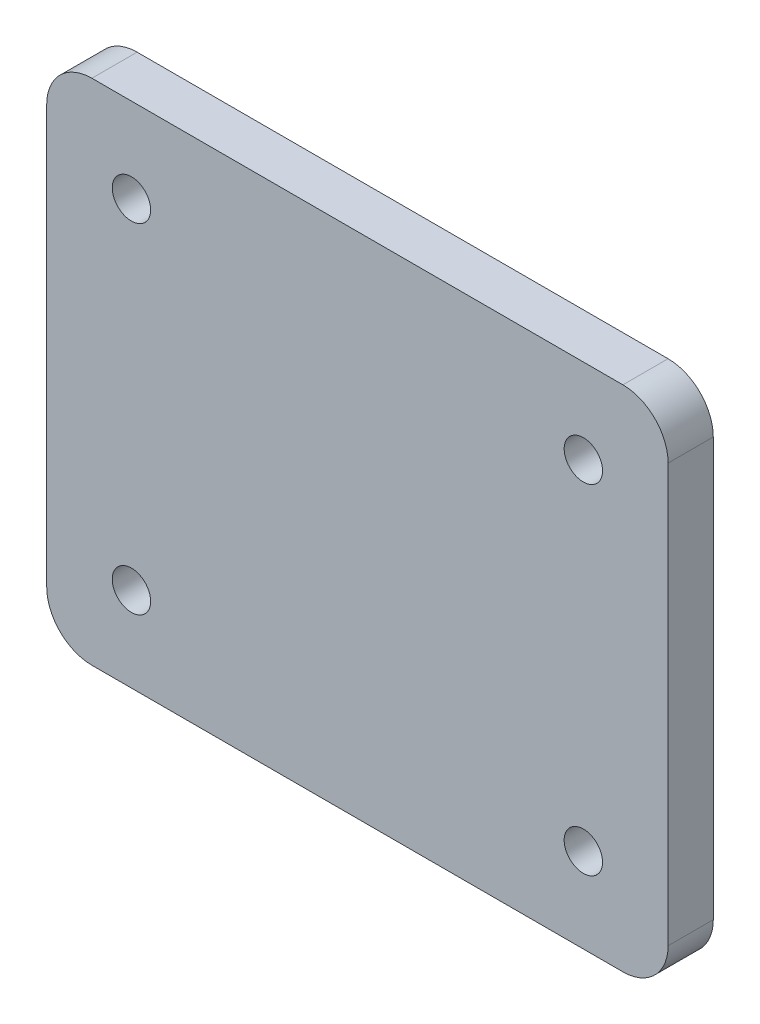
ISO-10303-21;
HEADER;
FILE_DESCRIPTION(('STEP AP214'),'2;1');
FILE_NAME('part.step','',(''),(''),'','','');
FILE_SCHEMA(('AUTOMOTIVE_DESIGN { 1 0 10303 214 1 1 1 1 }'));
ENDSEC;
DATA;
#1=APPLICATION_CONTEXT('core data for automotive mechanical design processes');
#2=APPLICATION_PROTOCOL_DEFINITION('international standard','automotive_design',2000,#1);
#3=PRODUCT_CONTEXT('',#1,'mechanical');
#4=PRODUCT('Part','Part','',(#3));
#5=PRODUCT_RELATED_PRODUCT_CATEGORY('part','',(#4));
#6=PRODUCT_DEFINITION_FORMATION('','',#4);
#7=PRODUCT_DEFINITION_CONTEXT('part definition',#1,'design');
#8=PRODUCT_DEFINITION('design','',#6,#7);
#9=PRODUCT_DEFINITION_SHAPE('','',#8);
#10=(LENGTH_UNIT() NAMED_UNIT(*) SI_UNIT(.MILLI.,.METRE.));
#11=(NAMED_UNIT(*) PLANE_ANGLE_UNIT() SI_UNIT($,.RADIAN.));
#12=(NAMED_UNIT(*) SI_UNIT($,.STERADIAN.) SOLID_ANGLE_UNIT());
#13=UNCERTAINTY_MEASURE_WITH_UNIT(LENGTH_MEASURE(1.E-05),#10,'distance_accuracy_value','');
#14=(GEOMETRIC_REPRESENTATION_CONTEXT(3) GLOBAL_UNCERTAINTY_ASSIGNED_CONTEXT((#13)) GLOBAL_UNIT_ASSIGNED_CONTEXT((#10,
#11,#12)) REPRESENTATION_CONTEXT('',''));
#15=CARTESIAN_POINT('',(0.,0.,0.));
#16=DIRECTION('',(0.,0.,1.));
#17=DIRECTION('',(1.,0.,0.));
#18=AXIS2_PLACEMENT_3D('',#15,#16,#17);
#19=CARTESIAN_POINT('',(102.,8.00000000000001,-8.));
#20=DIRECTION('',(0.,0.,1.));
#21=DIRECTION('',(1.,0.,0.));
#22=AXIS2_PLACEMENT_3D('',#19,#20,#21);
#23=CYLINDRICAL_SURFACE('',#22,8.00000000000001);
#24=CARTESIAN_POINT('',(102.,8.00000000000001,0.));
#25=DIRECTION('',(0.,0.,1.));
#26=DIRECTION('',(1.,0.,0.));
#27=AXIS2_PLACEMENT_3D('',#24,#25,#26);
#28=CIRCLE('',#27,8.00000000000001);
#29=CARTESIAN_POINT('',(102.,0.,0.));
#30=VERTEX_POINT('',#29);
#31=CARTESIAN_POINT('',(110.,8.00000000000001,0.));
#32=VERTEX_POINT('',#31);
#33=EDGE_CURVE('E129',#30,#32,#28,.T.);
#34=ORIENTED_EDGE('',*,*,#33,.F.);
#35=DIRECTION('',(0.,0.,1.));
#36=VECTOR('',#35,1.);
#37=CARTESIAN_POINT('',(102.,0.,-8.));
#38=LINE('',#37,#36);
#39=CARTESIAN_POINT('',(102.,0.,-8.));
#40=VERTEX_POINT('',#39);
#41=EDGE_CURVE('E11',#40,#30,#38,.T.);
#42=ORIENTED_EDGE('',*,*,#41,.F.);
#43=CARTESIAN_POINT('',(102.,8.00000000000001,-8.));
#44=DIRECTION('',(0.,0.,1.));
#45=DIRECTION('',(1.,0.,0.));
#46=AXIS2_PLACEMENT_3D('',#43,#44,#45);
#47=CIRCLE('',#46,8.00000000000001);
#48=CARTESIAN_POINT('',(110.,8.00000000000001,-8.));
#49=VERTEX_POINT('',#48);
#50=EDGE_CURVE('E150',#40,#49,#47,.T.);
#51=ORIENTED_EDGE('',*,*,#50,.T.);
#52=DIRECTION('',(0.,0.,1.));
#53=VECTOR('',#52,1.);
#54=CARTESIAN_POINT('',(110.,8.00000000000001,-8.));
#55=LINE('',#54,#53);
#56=EDGE_CURVE('E35',#49,#32,#55,.T.);
#57=ORIENTED_EDGE('',*,*,#56,.T.);
#58=EDGE_LOOP('',(#34,#42,#51,#57));
#59=FACE_BOUND('',#58,.T.);
#60=ADVANCED_FACE('F32',(#59),#23,.T.);
#61=CARTESIAN_POINT('',(102.,0.,-8.));
#62=DIRECTION('',(0.,-1.,0.));
#63=DIRECTION('',(0.,0.,-1.));
#64=AXIS2_PLACEMENT_3D('',#61,#62,#63);
#65=PLANE('',#64);
#66=DIRECTION('',(1.,0.,0.));
#67=VECTOR('',#66,1.);
#68=CARTESIAN_POINT('',(102.,0.,0.));
#69=LINE('',#68,#67);
#70=CARTESIAN_POINT('',(8.,0.,0.));
#71=VERTEX_POINT('',#70);
#72=EDGE_CURVE('E148',#71,#30,#69,.T.);
#73=ORIENTED_EDGE('',*,*,#72,.F.);
#74=DIRECTION('',(0.,0.,1.));
#75=VECTOR('',#74,1.);
#76=CARTESIAN_POINT('',(8.,0.,-8.));
#77=LINE('',#76,#75);
#78=CARTESIAN_POINT('',(8.,0.,-8.));
#79=VERTEX_POINT('',#78);
#80=EDGE_CURVE('E41',#79,#71,#77,.T.);
#81=ORIENTED_EDGE('',*,*,#80,.F.);
#82=DIRECTION('',(1.,0.,0.));
#83=VECTOR('',#82,1.);
#84=CARTESIAN_POINT('',(102.,0.,-8.));
#85=LINE('',#84,#83);
#86=EDGE_CURVE('E119',#79,#40,#85,.T.);
#87=ORIENTED_EDGE('',*,*,#86,.T.);
#88=ORIENTED_EDGE('',*,*,#41,.T.);
#89=EDGE_LOOP('',(#73,#81,#87,#88));
#90=FACE_BOUND('',#89,.T.);
#91=ADVANCED_FACE('F162',(#90),#65,.T.);
#92=CARTESIAN_POINT('',(8.,8.00000000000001,-8.));
#93=DIRECTION('',(0.,0.,1.));
#94=DIRECTION('',(1.,0.,0.));
#95=AXIS2_PLACEMENT_3D('',#92,#93,#94);
#96=CYLINDRICAL_SURFACE('',#95,8.);
#97=CARTESIAN_POINT('',(8.,8.00000000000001,0.));
#98=DIRECTION('',(0.,0.,1.));
#99=DIRECTION('',(1.,0.,0.));
#100=AXIS2_PLACEMENT_3D('',#97,#98,#99);
#101=CIRCLE('',#100,8.);
#102=CARTESIAN_POINT('',(0.,8.00000000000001,0.));
#103=VERTEX_POINT('',#102);
#104=EDGE_CURVE('E106',#103,#71,#101,.T.);
#105=ORIENTED_EDGE('',*,*,#104,.F.);
#106=DIRECTION('',(0.,0.,1.));
#107=VECTOR('',#106,1.);
#108=CARTESIAN_POINT('',(0.,8.00000000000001,-8.));
#109=LINE('',#108,#107);
#110=CARTESIAN_POINT('',(0.,8.00000000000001,-8.));
#111=VERTEX_POINT('',#110);
#112=EDGE_CURVE('E101',#111,#103,#109,.T.);
#113=ORIENTED_EDGE('',*,*,#112,.F.);
#114=CARTESIAN_POINT('',(8.,8.00000000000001,-8.));
#115=DIRECTION('',(0.,0.,1.));
#116=DIRECTION('',(1.,0.,0.));
#117=AXIS2_PLACEMENT_3D('',#114,#115,#116);
#118=CIRCLE('',#117,8.);
#119=EDGE_CURVE('E104',#111,#79,#118,.T.);
#120=ORIENTED_EDGE('',*,*,#119,.T.);
#121=ORIENTED_EDGE('',*,*,#80,.T.);
#122=EDGE_LOOP('',(#105,#113,#120,#121));
#123=FACE_BOUND('',#122,.T.);
#124=ADVANCED_FACE('F103',(#123),#96,.T.);
#125=CARTESIAN_POINT('',(0.,8.00000000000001,-8.));
#126=DIRECTION('',(-1.,0.,0.));
#127=DIRECTION('',(0.,0.,1.));
#128=AXIS2_PLACEMENT_3D('',#125,#126,#127);
#129=PLANE('',#128);
#130=DIRECTION('',(0.,-1.,0.));
#131=VECTOR('',#130,1.);
#132=CARTESIAN_POINT('',(0.,8.00000000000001,0.));
#133=LINE('',#132,#131);
#134=CARTESIAN_POINT('',(0.,82.,0.));
#135=VERTEX_POINT('',#134);
#136=EDGE_CURVE('E145',#135,#103,#133,.T.);
#137=ORIENTED_EDGE('',*,*,#136,.F.);
#138=DIRECTION('',(0.,0.,1.));
#139=VECTOR('',#138,1.);
#140=CARTESIAN_POINT('',(0.,82.,-8.));
#141=LINE('',#140,#139);
#142=CARTESIAN_POINT('',(0.,82.,-8.));
#143=VERTEX_POINT('',#142);
#144=EDGE_CURVE('E111',#143,#135,#141,.T.);
#145=ORIENTED_EDGE('',*,*,#144,.F.);
#146=DIRECTION('',(0.,-1.,0.));
#147=VECTOR('',#146,1.);
#148=CARTESIAN_POINT('',(0.,8.00000000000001,-8.));
#149=LINE('',#148,#147);
#150=EDGE_CURVE('E117',#143,#111,#149,.T.);
#151=ORIENTED_EDGE('',*,*,#150,.T.);
#152=ORIENTED_EDGE('',*,*,#112,.T.);
#153=EDGE_LOOP('',(#137,#145,#151,#152));
#154=FACE_BOUND('',#153,.T.);
#155=ADVANCED_FACE('F121',(#154),#129,.T.);
#156=CARTESIAN_POINT('',(8.,82.,-8.));
#157=DIRECTION('',(0.,0.,1.));
#158=DIRECTION('',(1.,0.,0.));
#159=AXIS2_PLACEMENT_3D('',#156,#157,#158);
#160=CYLINDRICAL_SURFACE('',#159,8.);
#161=CARTESIAN_POINT('',(8.,82.,0.));
#162=DIRECTION('',(0.,0.,1.));
#163=DIRECTION('',(1.,0.,0.));
#164=AXIS2_PLACEMENT_3D('',#161,#162,#163);
#165=CIRCLE('',#164,8.);
#166=CARTESIAN_POINT('',(8.,90.,0.));
#167=VERTEX_POINT('',#166);
#168=EDGE_CURVE('E142',#167,#135,#165,.T.);
#169=ORIENTED_EDGE('',*,*,#168,.F.);
#170=DIRECTION('',(0.,0.,1.));
#171=VECTOR('',#170,1.);
#172=CARTESIAN_POINT('',(8.,90.,-8.));
#173=LINE('',#172,#171);
#174=CARTESIAN_POINT('',(8.,90.,-8.));
#175=VERTEX_POINT('',#174);
#176=EDGE_CURVE('E154',#175,#167,#173,.T.);
#177=ORIENTED_EDGE('',*,*,#176,.F.);
#178=CARTESIAN_POINT('',(8.,82.,-8.));
#179=DIRECTION('',(0.,0.,1.));
#180=DIRECTION('',(1.,0.,0.));
#181=AXIS2_PLACEMENT_3D('',#178,#179,#180);
#182=CIRCLE('',#181,8.);
#183=EDGE_CURVE('E122',#175,#143,#182,.T.);
#184=ORIENTED_EDGE('',*,*,#183,.T.);
#185=ORIENTED_EDGE('',*,*,#144,.T.);
#186=EDGE_LOOP('',(#169,#177,#184,#185));
#187=FACE_BOUND('',#186,.T.);
#188=ADVANCED_FACE('F175',(#187),#160,.T.);
#189=CARTESIAN_POINT('',(102.,90.,-8.));
#190=DIRECTION('',(0.,1.,0.));
#191=DIRECTION('',(0.,0.,1.));
#192=AXIS2_PLACEMENT_3D('',#189,#190,#191);
#193=PLANE('',#192);
#194=DIRECTION('',(-1.,0.,0.));
#195=VECTOR('',#194,1.);
#196=CARTESIAN_POINT('',(102.,90.,0.));
#197=LINE('',#196,#195);
#198=CARTESIAN_POINT('',(102.,90.,0.));
#199=VERTEX_POINT('',#198);
#200=EDGE_CURVE('E139',#199,#167,#197,.T.);
#201=ORIENTED_EDGE('',*,*,#200,.F.);
#202=DIRECTION('',(0.,0.,1.));
#203=VECTOR('',#202,1.);
#204=CARTESIAN_POINT('',(102.,90.,-8.));
#205=LINE('',#204,#203);
#206=CARTESIAN_POINT('',(102.,90.,-8.));
#207=VERTEX_POINT('',#206);
#208=EDGE_CURVE('E156',#207,#199,#205,.T.);
#209=ORIENTED_EDGE('',*,*,#208,.F.);
#210=DIRECTION('',(-1.,0.,0.));
#211=VECTOR('',#210,1.);
#212=CARTESIAN_POINT('',(102.,90.,-8.));
#213=LINE('',#212,#211);
#214=EDGE_CURVE('E124',#207,#175,#213,.T.);
#215=ORIENTED_EDGE('',*,*,#214,.T.);
#216=ORIENTED_EDGE('',*,*,#176,.T.);
#217=EDGE_LOOP('',(#201,#209,#215,#216));
#218=FACE_BOUND('',#217,.T.);
#219=ADVANCED_FACE('F178',(#218),#193,.T.);
#220=CARTESIAN_POINT('',(102.,82.,-8.));
#221=DIRECTION('',(0.,0.,1.));
#222=DIRECTION('',(1.,0.,0.));
#223=AXIS2_PLACEMENT_3D('',#220,#221,#222);
#224=CYLINDRICAL_SURFACE('',#223,8.00000000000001);
#225=CARTESIAN_POINT('',(102.,82.,0.));
#226=DIRECTION('',(0.,0.,1.));
#227=DIRECTION('',(1.,0.,0.));
#228=AXIS2_PLACEMENT_3D('',#225,#226,#227);
#229=CIRCLE('',#228,8.00000000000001);
#230=CARTESIAN_POINT('',(110.,82.,0.));
#231=VERTEX_POINT('',#230);
#232=EDGE_CURVE('E136',#231,#199,#229,.T.);
#233=ORIENTED_EDGE('',*,*,#232,.F.);
#234=DIRECTION('',(0.,0.,1.));
#235=VECTOR('',#234,1.);
#236=CARTESIAN_POINT('',(110.,82.,-8.));
#237=LINE('',#236,#235);
#238=CARTESIAN_POINT('',(110.,82.,-8.));
#239=VERTEX_POINT('',#238);
#240=EDGE_CURVE('E157',#239,#231,#237,.T.);
#241=ORIENTED_EDGE('',*,*,#240,.F.);
#242=CARTESIAN_POINT('',(102.,82.,-8.));
#243=DIRECTION('',(0.,0.,1.));
#244=DIRECTION('',(1.,0.,0.));
#245=AXIS2_PLACEMENT_3D('',#242,#243,#244);
#246=CIRCLE('',#245,8.00000000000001);
#247=EDGE_CURVE('E244',#239,#207,#246,.T.);
#248=ORIENTED_EDGE('',*,*,#247,.T.);
#249=ORIENTED_EDGE('',*,*,#208,.T.);
#250=EDGE_LOOP('',(#233,#241,#248,#249));
#251=FACE_BOUND('',#250,.T.);
#252=ADVANCED_FACE('F182',(#251),#224,.T.);
#253=CARTESIAN_POINT('',(110.,8.00000000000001,-8.));
#254=DIRECTION('',(1.,0.,0.));
#255=DIRECTION('',(0.,0.,-1.));
#256=AXIS2_PLACEMENT_3D('',#253,#254,#255);
#257=PLANE('',#256);
#258=DIRECTION('',(0.,1.,0.));
#259=VECTOR('',#258,1.);
#260=CARTESIAN_POINT('',(110.,8.00000000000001,0.));
#261=LINE('',#260,#259);
#262=EDGE_CURVE('E132',#32,#231,#261,.T.);
#263=ORIENTED_EDGE('',*,*,#262,.F.);
#264=ORIENTED_EDGE('',*,*,#56,.F.);
#265=DIRECTION('',(0.,1.,0.));
#266=VECTOR('',#265,1.);
#267=CARTESIAN_POINT('',(110.,8.00000000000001,-8.));
#268=LINE('',#267,#266);
#269=EDGE_CURVE('E242',#49,#239,#268,.T.);
#270=ORIENTED_EDGE('',*,*,#269,.T.);
#271=ORIENTED_EDGE('',*,*,#240,.T.);
#272=EDGE_LOOP('',(#263,#264,#270,#271));
#273=FACE_BOUND('',#272,.T.);
#274=ADVANCED_FACE('F159',(#273),#257,.T.);
#275=CARTESIAN_POINT('',(102.,8.00000000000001,-8.));
#276=DIRECTION('',(0.,0.,1.));
#277=DIRECTION('',(1.,0.,0.));
#278=AXIS2_PLACEMENT_3D('',#275,#276,#277);
#279=PLANE('',#278);
#280=CARTESIAN_POINT('',(15.,75.,-8.));
#281=DIRECTION('',(0.,0.,1.));
#282=DIRECTION('',(1.,0.,0.));
#283=AXIS2_PLACEMENT_3D('',#280,#281,#282);
#284=CIRCLE('',#283,3.4);
#285=CARTESIAN_POINT('',(18.4,75.,-8.));
#286=VERTEX_POINT('',#285);
#287=EDGE_CURVE('E217',#286,#286,#284,.T.);
#288=ORIENTED_EDGE('',*,*,#287,.T.);
#289=EDGE_LOOP('',(#288));
#290=FACE_BOUND('',#289,.T.);
#291=CARTESIAN_POINT('',(15.,15.,-8.));
#292=DIRECTION('',(0.,0.,1.));
#293=DIRECTION('',(1.,0.,0.));
#294=AXIS2_PLACEMENT_3D('',#291,#292,#293);
#295=CIRCLE('',#294,3.4);
#296=CARTESIAN_POINT('',(18.4,15.,-8.));
#297=VERTEX_POINT('',#296);
#298=EDGE_CURVE('E227',#297,#297,#295,.T.);
#299=ORIENTED_EDGE('',*,*,#298,.T.);
#300=EDGE_LOOP('',(#299));
#301=FACE_BOUND('',#300,.T.);
#302=CARTESIAN_POINT('',(95.,15.,-8.));
#303=DIRECTION('',(0.,0.,1.));
#304=DIRECTION('',(1.,0.,0.));
#305=AXIS2_PLACEMENT_3D('',#302,#303,#304);
#306=CIRCLE('',#305,3.4);
#307=CARTESIAN_POINT('',(98.4,15.,-8.));
#308=VERTEX_POINT('',#307);
#309=EDGE_CURVE('E233',#308,#308,#306,.T.);
#310=ORIENTED_EDGE('',*,*,#309,.T.);
#311=EDGE_LOOP('',(#310));
#312=FACE_BOUND('',#311,.T.);
#313=CARTESIAN_POINT('',(95.,75.,-8.));
#314=DIRECTION('',(0.,0.,1.));
#315=DIRECTION('',(1.,0.,0.));
#316=AXIS2_PLACEMENT_3D('',#313,#314,#315);
#317=CIRCLE('',#316,3.4);
#318=CARTESIAN_POINT('',(98.4,75.,-8.));
#319=VERTEX_POINT('',#318);
#320=EDGE_CURVE('E133',#319,#319,#317,.T.);
#321=ORIENTED_EDGE('',*,*,#320,.T.);
#322=EDGE_LOOP('',(#321));
#323=FACE_BOUND('',#322,.T.);
#324=ORIENTED_EDGE('',*,*,#50,.F.);
#325=ORIENTED_EDGE('',*,*,#86,.F.);
#326=ORIENTED_EDGE('',*,*,#119,.F.);
#327=ORIENTED_EDGE('',*,*,#150,.F.);
#328=ORIENTED_EDGE('',*,*,#183,.F.);
#329=ORIENTED_EDGE('',*,*,#214,.F.);
#330=ORIENTED_EDGE('',*,*,#247,.F.);
#331=ORIENTED_EDGE('',*,*,#269,.F.);
#332=EDGE_LOOP('',(#324,#325,#326,#327,#328,#329,#330,#331));
#333=FACE_BOUND('',#332,.T.);
#334=ADVANCED_FACE('F115',(#290,#301,#312,#323,#333),#279,.F.);
#335=CARTESIAN_POINT('',(102.,8.00000000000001,0.));
#336=DIRECTION('',(0.,0.,1.));
#337=DIRECTION('',(1.,0.,0.));
#338=AXIS2_PLACEMENT_3D('',#335,#336,#337);
#339=PLANE('',#338);
#340=CARTESIAN_POINT('',(15.,75.,0.));
#341=DIRECTION('',(0.,0.,1.));
#342=DIRECTION('',(1.,0.,0.));
#343=AXIS2_PLACEMENT_3D('',#340,#341,#342);
#344=CIRCLE('',#343,3.39999999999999);
#345=CARTESIAN_POINT('',(18.4,75.,0.));
#346=VERTEX_POINT('',#345);
#347=EDGE_CURVE('E220',#346,#346,#344,.T.);
#348=ORIENTED_EDGE('',*,*,#347,.F.);
#349=EDGE_LOOP('',(#348));
#350=FACE_BOUND('',#349,.T.);
#351=CARTESIAN_POINT('',(15.,15.,0.));
#352=DIRECTION('',(0.,0.,1.));
#353=DIRECTION('',(1.,0.,0.));
#354=AXIS2_PLACEMENT_3D('',#351,#352,#353);
#355=CIRCLE('',#354,3.39999999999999);
#356=CARTESIAN_POINT('',(18.4,15.,0.));
#357=VERTEX_POINT('',#356);
#358=EDGE_CURVE('E222',#357,#357,#355,.T.);
#359=ORIENTED_EDGE('',*,*,#358,.F.);
#360=EDGE_LOOP('',(#359));
#361=FACE_BOUND('',#360,.T.);
#362=CARTESIAN_POINT('',(95.,15.,0.));
#363=DIRECTION('',(0.,0.,1.));
#364=DIRECTION('',(1.,0.,0.));
#365=AXIS2_PLACEMENT_3D('',#362,#363,#364);
#366=CIRCLE('',#365,3.39999999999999);
#367=CARTESIAN_POINT('',(98.4,15.,0.));
#368=VERTEX_POINT('',#367);
#369=EDGE_CURVE('E230',#368,#368,#366,.T.);
#370=ORIENTED_EDGE('',*,*,#369,.F.);
#371=EDGE_LOOP('',(#370));
#372=FACE_BOUND('',#371,.T.);
#373=CARTESIAN_POINT('',(95.,75.,0.));
#374=DIRECTION('',(0.,0.,1.));
#375=DIRECTION('',(1.,0.,0.));
#376=AXIS2_PLACEMENT_3D('',#373,#374,#375);
#377=CIRCLE('',#376,3.39999999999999);
#378=CARTESIAN_POINT('',(98.4,75.,0.));
#379=VERTEX_POINT('',#378);
#380=EDGE_CURVE('E236',#379,#379,#377,.T.);
#381=ORIENTED_EDGE('',*,*,#380,.F.);
#382=EDGE_LOOP('',(#381));
#383=FACE_BOUND('',#382,.T.);
#384=ORIENTED_EDGE('',*,*,#33,.T.);
#385=ORIENTED_EDGE('',*,*,#262,.T.);
#386=ORIENTED_EDGE('',*,*,#232,.T.);
#387=ORIENTED_EDGE('',*,*,#200,.T.);
#388=ORIENTED_EDGE('',*,*,#168,.T.);
#389=ORIENTED_EDGE('',*,*,#136,.T.);
#390=ORIENTED_EDGE('',*,*,#104,.T.);
#391=ORIENTED_EDGE('',*,*,#72,.T.);
#392=EDGE_LOOP('',(#384,#385,#386,#387,#388,#389,#390,#391));
#393=FACE_BOUND('',#392,.T.);
#394=ADVANCED_FACE('F161',(#350,#361,#372,#383,#393),#339,.T.);
#395=CARTESIAN_POINT('',(95.,75.,0.));
#396=DIRECTION('',(0.,0.,1.));
#397=DIRECTION('',(1.,0.,0.));
#398=AXIS2_PLACEMENT_3D('',#395,#396,#397);
#399=CYLINDRICAL_SURFACE('',#398,3.39999999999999);
#400=ORIENTED_EDGE('',*,*,#320,.F.);
#401=EDGE_LOOP('',(#400));
#402=FACE_BOUND('',#401,.T.);
#403=ORIENTED_EDGE('',*,*,#380,.T.);
#404=EDGE_LOOP('',(#403));
#405=FACE_BOUND('',#404,.T.);
#406=ADVANCED_FACE('F194',(#402,#405),#399,.F.);
#407=CARTESIAN_POINT('',(95.,15.,0.));
#408=DIRECTION('',(0.,0.,1.));
#409=DIRECTION('',(1.,0.,0.));
#410=AXIS2_PLACEMENT_3D('',#407,#408,#409);
#411=CYLINDRICAL_SURFACE('',#410,3.39999999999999);
#412=ORIENTED_EDGE('',*,*,#309,.F.);
#413=EDGE_LOOP('',(#412));
#414=FACE_BOUND('',#413,.T.);
#415=ORIENTED_EDGE('',*,*,#369,.T.);
#416=EDGE_LOOP('',(#415));
#417=FACE_BOUND('',#416,.T.);
#418=ADVANCED_FACE('F201',(#414,#417),#411,.F.);
#419=CARTESIAN_POINT('',(15.,15.,0.));
#420=DIRECTION('',(0.,0.,1.));
#421=DIRECTION('',(1.,0.,0.));
#422=AXIS2_PLACEMENT_3D('',#419,#420,#421);
#423=CYLINDRICAL_SURFACE('',#422,3.39999999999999);
#424=ORIENTED_EDGE('',*,*,#298,.F.);
#425=EDGE_LOOP('',(#424));
#426=FACE_BOUND('',#425,.T.);
#427=ORIENTED_EDGE('',*,*,#358,.T.);
#428=EDGE_LOOP('',(#427));
#429=FACE_BOUND('',#428,.T.);
#430=ADVANCED_FACE('F205',(#426,#429),#423,.F.);
#431=CARTESIAN_POINT('',(15.,75.,0.));
#432=DIRECTION('',(0.,0.,1.));
#433=DIRECTION('',(1.,0.,0.));
#434=AXIS2_PLACEMENT_3D('',#431,#432,#433);
#435=CYLINDRICAL_SURFACE('',#434,3.39999999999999);
#436=ORIENTED_EDGE('',*,*,#287,.F.);
#437=EDGE_LOOP('',(#436));
#438=FACE_BOUND('',#437,.T.);
#439=ORIENTED_EDGE('',*,*,#347,.T.);
#440=EDGE_LOOP('',(#439));
#441=FACE_BOUND('',#440,.T.);
#442=ADVANCED_FACE('F209',(#438,#441),#435,.F.);
#443=CLOSED_SHELL('',(#60,#91,#124,#155,#188,#219,#252,#274,#334,#394,#406,#418,#430,#442));
#444=MANIFOLD_SOLID_BREP('B2',#443);
#445=ADVANCED_BREP_SHAPE_REPRESENTATION('',(#18,#444),#14);
#446=SHAPE_DEFINITION_REPRESENTATION(#9,#445);
ENDSEC;
END-ISO-10303-21;
